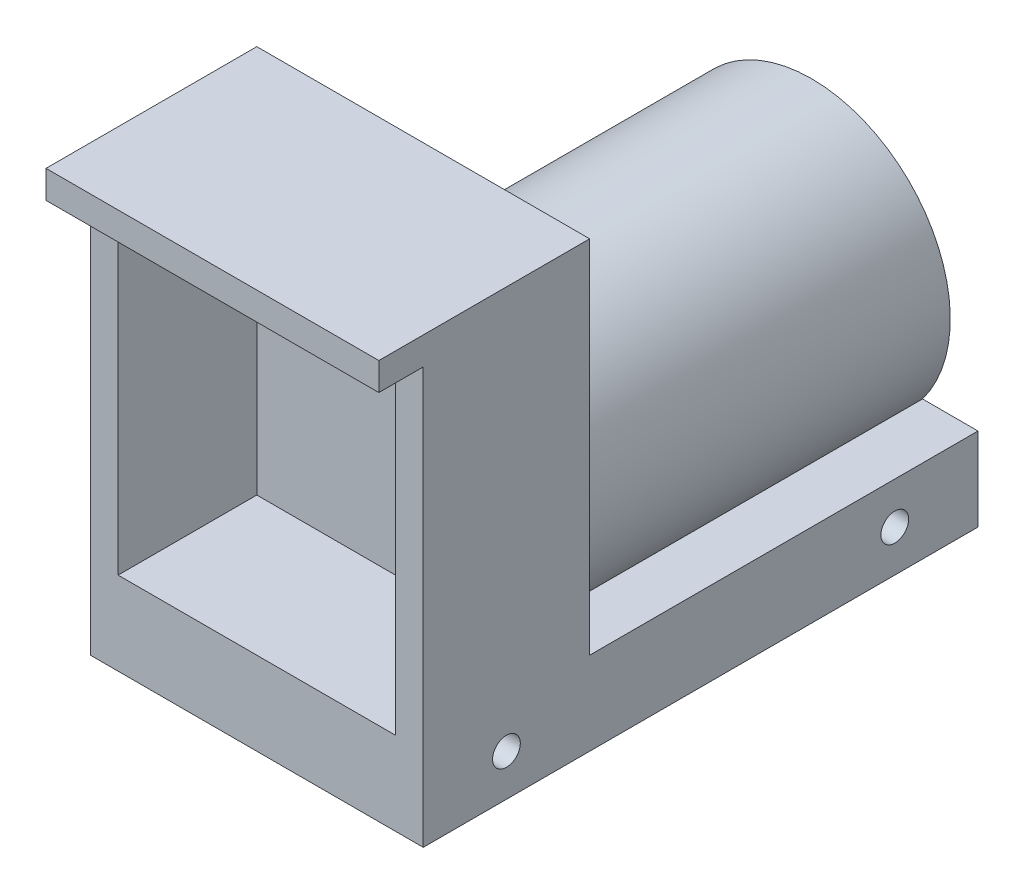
ISO-10303-21;
HEADER;
FILE_DESCRIPTION(('STEP AP214'),'2;1');
FILE_NAME('part.step','',(''),(''),'','','');
FILE_SCHEMA(('AUTOMOTIVE_DESIGN { 1 0 10303 214 1 1 1 1 }'));
ENDSEC;
DATA;
#1=APPLICATION_CONTEXT('core data for automotive mechanical design processes');
#2=APPLICATION_PROTOCOL_DEFINITION('international standard','automotive_design',2000,#1);
#3=PRODUCT_CONTEXT('',#1,'mechanical');
#4=PRODUCT('Part','Part','',(#3));
#5=PRODUCT_RELATED_PRODUCT_CATEGORY('part','',(#4));
#6=PRODUCT_DEFINITION_FORMATION('','',#4);
#7=PRODUCT_DEFINITION_CONTEXT('part definition',#1,'design');
#8=PRODUCT_DEFINITION('design','',#6,#7);
#9=PRODUCT_DEFINITION_SHAPE('','',#8);
#10=(LENGTH_UNIT() NAMED_UNIT(*) SI_UNIT(.MILLI.,.METRE.));
#11=(NAMED_UNIT(*) PLANE_ANGLE_UNIT() SI_UNIT($,.RADIAN.));
#12=(NAMED_UNIT(*) SI_UNIT($,.STERADIAN.) SOLID_ANGLE_UNIT());
#13=UNCERTAINTY_MEASURE_WITH_UNIT(LENGTH_MEASURE(1.E-05),#10,'distance_accuracy_value','');
#14=(GEOMETRIC_REPRESENTATION_CONTEXT(3) GLOBAL_UNCERTAINTY_ASSIGNED_CONTEXT((#13)) GLOBAL_UNIT_ASSIGNED_CONTEXT((#10,
#11,#12)) REPRESENTATION_CONTEXT('',''));
#15=CARTESIAN_POINT('',(0.,0.,0.));
#16=DIRECTION('',(0.,0.,1.));
#17=DIRECTION('',(1.,0.,0.));
#18=AXIS2_PLACEMENT_3D('',#15,#16,#17);
#19=CARTESIAN_POINT('',(30.,15.,-50.));
#20=DIRECTION('',(0.,-1.,0.));
#21=DIRECTION('',(0.,0.,-1.));
#22=AXIS2_PLACEMENT_3D('',#19,#20,#21);
#23=PLANE('',#22);
#24=DIRECTION('',(-1.,0.,0.));
#25=VECTOR('',#24,1.);
#26=CARTESIAN_POINT('',(30.,15.,20.));
#27=LINE('',#26,#25);
#28=CARTESIAN_POINT('',(-20.,15.,20.));
#29=VERTEX_POINT('',#28);
#30=CARTESIAN_POINT('',(-30.,15.,20.));
#31=VERTEX_POINT('',#30);
#32=EDGE_CURVE('E228',#29,#31,#27,.T.);
#33=ORIENTED_EDGE('',*,*,#32,.F.);
#34=DIRECTION('',(0.,0.,-1.));
#35=VECTOR('',#34,1.);
#36=CARTESIAN_POINT('',(-20.,15.,90.7106781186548));
#37=LINE('',#36,#35);
#38=CARTESIAN_POINT('',(-20.,14.9999999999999,-50.));
#39=VERTEX_POINT('',#38);
#40=EDGE_CURVE('E58',#29,#39,#37,.T.);
#41=ORIENTED_EDGE('',*,*,#40,.T.);
#42=DIRECTION('',(-1.,0.,0.));
#43=VECTOR('',#42,1.);
#44=CARTESIAN_POINT('',(30.,15.,-50.));
#45=LINE('',#44,#43);
#46=CARTESIAN_POINT('',(-30.,15.,-50.));
#47=VERTEX_POINT('',#46);
#48=EDGE_CURVE('E232',#39,#47,#45,.T.);
#49=ORIENTED_EDGE('',*,*,#48,.T.);
#50=DIRECTION('',(0.,0.,1.));
#51=VECTOR('',#50,1.);
#52=CARTESIAN_POINT('',(-30.,15.,-50.));
#53=LINE('',#52,#51);
#54=EDGE_CURVE('E206',#47,#31,#53,.T.);
#55=ORIENTED_EDGE('',*,*,#54,.T.);
#56=EDGE_LOOP('',(#33,#41,#49,#55));
#57=FACE_BOUND('',#56,.T.);
#58=ADVANCED_FACE('F35',(#57),#23,.F.);
#59=CARTESIAN_POINT('',(30.,75.,50.));
#60=DIRECTION('',(0.,0.,-1.));
#61=DIRECTION('',(0.,1.,0.));
#62=AXIS2_PLACEMENT_3D('',#59,#60,#61);
#63=PLANE('',#62);
#64=DIRECTION('',(1.,0.,0.));
#65=VECTOR('',#64,1.);
#66=CARTESIAN_POINT('',(-25.,15.,50.));
#67=LINE('',#66,#65);
#68=CARTESIAN_POINT('',(-25.,15.,50.));
#69=VERTEX_POINT('',#68);
#70=CARTESIAN_POINT('',(25.,15.,50.));
#71=VERTEX_POINT('',#70);
#72=EDGE_CURVE('E142',#69,#71,#67,.T.);
#73=ORIENTED_EDGE('',*,*,#72,.F.);
#74=DIRECTION('',(0.,-1.,0.));
#75=VECTOR('',#74,1.);
#76=CARTESIAN_POINT('',(-25.,75.,50.));
#77=LINE('',#76,#75);
#78=CARTESIAN_POINT('',(-25.,75.,50.));
#79=VERTEX_POINT('',#78);
#80=EDGE_CURVE('E150',#79,#69,#77,.T.);
#81=ORIENTED_EDGE('',*,*,#80,.F.);
#82=DIRECTION('',(-1.,0.,0.));
#83=VECTOR('',#82,1.);
#84=CARTESIAN_POINT('',(30.,75.,50.));
#85=LINE('',#84,#83);
#86=CARTESIAN_POINT('',(-30.,75.,50.));
#87=VERTEX_POINT('',#86);
#88=EDGE_CURVE('E198',#79,#87,#85,.T.);
#89=ORIENTED_EDGE('',*,*,#88,.T.);
#90=DIRECTION('',(0.,-1.,0.));
#91=VECTOR('',#90,1.);
#92=CARTESIAN_POINT('',(-30.,75.,50.));
#93=LINE('',#92,#91);
#94=CARTESIAN_POINT('',(-30.,0.,50.));
#95=VERTEX_POINT('',#94);
#96=EDGE_CURVE('E179',#87,#95,#93,.T.);
#97=ORIENTED_EDGE('',*,*,#96,.T.);
#98=DIRECTION('',(-1.,0.,0.));
#99=VECTOR('',#98,1.);
#100=CARTESIAN_POINT('',(30.,0.,50.));
#101=LINE('',#100,#99);
#102=CARTESIAN_POINT('',(30.,0.,50.));
#103=VERTEX_POINT('',#102);
#104=EDGE_CURVE('E12',#103,#95,#101,.T.);
#105=ORIENTED_EDGE('',*,*,#104,.F.);
#106=DIRECTION('',(0.,-1.,0.));
#107=VECTOR('',#106,1.);
#108=CARTESIAN_POINT('',(30.,75.,50.));
#109=LINE('',#108,#107);
#110=CARTESIAN_POINT('',(30.,75.,50.));
#111=VERTEX_POINT('',#110);
#112=EDGE_CURVE('E180',#111,#103,#109,.T.);
#113=ORIENTED_EDGE('',*,*,#112,.F.);
#114=CARTESIAN_POINT('',(25.,75.,50.));
#115=VERTEX_POINT('',#114);
#116=EDGE_CURVE('E217',#111,#115,#85,.T.);
#117=ORIENTED_EDGE('',*,*,#116,.T.);
#118=DIRECTION('',(0.,1.,0.));
#119=VECTOR('',#118,1.);
#120=CARTESIAN_POINT('',(25.,75.,50.));
#121=LINE('',#120,#119);
#122=EDGE_CURVE('E50',#71,#115,#121,.T.);
#123=ORIENTED_EDGE('',*,*,#122,.F.);
#124=EDGE_LOOP('',(#73,#81,#89,#97,#105,#113,#117,#123));
#125=FACE_BOUND('',#124,.T.);
#126=ADVANCED_FACE('F37',(#125),#63,.F.);
#127=CARTESIAN_POINT('',(30.,0.,50.));
#128=DIRECTION('',(0.,1.,0.));
#129=DIRECTION('',(0.,0.,1.));
#130=AXIS2_PLACEMENT_3D('',#127,#128,#129);
#131=PLANE('',#130);
#132=DIRECTION('',(0.,0.,-1.));
#133=VECTOR('',#132,1.);
#134=CARTESIAN_POINT('',(-30.,0.,50.));
#135=LINE('',#134,#133);
#136=CARTESIAN_POINT('',(-30.,0.,-50.));
#137=VERTEX_POINT('',#136);
#138=EDGE_CURVE('E201',#95,#137,#135,.T.);
#139=ORIENTED_EDGE('',*,*,#138,.T.);
#140=DIRECTION('',(-1.,0.,0.));
#141=VECTOR('',#140,1.);
#142=CARTESIAN_POINT('',(30.,0.,-50.));
#143=LINE('',#142,#141);
#144=CARTESIAN_POINT('',(30.,0.,-50.));
#145=VERTEX_POINT('',#144);
#146=EDGE_CURVE('E43',#145,#137,#143,.T.);
#147=ORIENTED_EDGE('',*,*,#146,.F.);
#148=DIRECTION('',(0.,0.,-1.));
#149=VECTOR('',#148,1.);
#150=CARTESIAN_POINT('',(30.,0.,50.));
#151=LINE('',#150,#149);
#152=EDGE_CURVE('E183',#103,#145,#151,.T.);
#153=ORIENTED_EDGE('',*,*,#152,.F.);
#154=ORIENTED_EDGE('',*,*,#104,.T.);
#155=EDGE_LOOP('',(#139,#147,#153,#154));
#156=FACE_BOUND('',#155,.T.);
#157=ADVANCED_FACE('F262',(#156),#131,.F.);
#158=CARTESIAN_POINT('',(30.,0.,-50.));
#159=DIRECTION('',(0.,0.,1.));
#160=DIRECTION('',(0.,-1.,0.));
#161=AXIS2_PLACEMENT_3D('',#158,#159,#160);
#162=PLANE('',#161);
#163=ORIENTED_EDGE('',*,*,#48,.F.);
#164=CARTESIAN_POINT('',(0.,30.,-50.));
#165=DIRECTION('',(0.,0.,-1.));
#166=DIRECTION('',(0.,1.,0.));
#167=AXIS2_PLACEMENT_3D('',#164,#165,#166);
#168=CIRCLE('',#167,25.);
#169=CARTESIAN_POINT('',(20.,14.9999999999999,-50.));
#170=VERTEX_POINT('',#169);
#171=EDGE_CURVE('E169',#39,#170,#168,.T.);
#172=ORIENTED_EDGE('',*,*,#171,.T.);
#173=CARTESIAN_POINT('',(30.,15.,-50.));
#174=VERTEX_POINT('',#173);
#175=EDGE_CURVE('E233',#174,#170,#45,.T.);
#176=ORIENTED_EDGE('',*,*,#175,.F.);
#177=DIRECTION('',(0.,1.,0.));
#178=VECTOR('',#177,1.);
#179=CARTESIAN_POINT('',(30.,0.,-50.));
#180=LINE('',#179,#178);
#181=EDGE_CURVE('E186',#145,#174,#180,.T.);
#182=ORIENTED_EDGE('',*,*,#181,.F.);
#183=ORIENTED_EDGE('',*,*,#146,.T.);
#184=DIRECTION('',(0.,1.,0.));
#185=VECTOR('',#184,1.);
#186=CARTESIAN_POINT('',(-30.,0.,-50.));
#187=LINE('',#186,#185);
#188=EDGE_CURVE('E203',#137,#47,#187,.T.);
#189=ORIENTED_EDGE('',*,*,#188,.T.);
#190=EDGE_LOOP('',(#163,#172,#176,#182,#183,#189));
#191=FACE_BOUND('',#190,.T.);
#192=ADVANCED_FACE('F241',(#191),#162,.F.);
#193=ORIENTED_EDGE('',*,*,#175,.T.);
#194=DIRECTION('',(0.,0.,-1.));
#195=VECTOR('',#194,1.);
#196=CARTESIAN_POINT('',(20.,15.,90.7106781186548));
#197=LINE('',#196,#195);
#198=CARTESIAN_POINT('',(20.,15.,20.));
#199=VERTEX_POINT('',#198);
#200=EDGE_CURVE('E175',#170,#199,#197,.F.);
#201=ORIENTED_EDGE('',*,*,#200,.T.);
#202=CARTESIAN_POINT('',(30.,15.,20.));
#203=VERTEX_POINT('',#202);
#204=EDGE_CURVE('E229',#203,#199,#27,.T.);
#205=ORIENTED_EDGE('',*,*,#204,.F.);
#206=DIRECTION('',(0.,0.,1.));
#207=VECTOR('',#206,1.);
#208=CARTESIAN_POINT('',(30.,15.,-50.));
#209=LINE('',#208,#207);
#210=EDGE_CURVE('E188',#174,#203,#209,.T.);
#211=ORIENTED_EDGE('',*,*,#210,.F.);
#212=EDGE_LOOP('',(#193,#201,#205,#211));
#213=FACE_BOUND('',#212,.T.);
#214=ADVANCED_FACE('F254',(#213),#23,.F.);
#215=CARTESIAN_POINT('',(30.,15.,20.));
#216=DIRECTION('',(0.,0.,1.));
#217=DIRECTION('',(0.,-1.,0.));
#218=AXIS2_PLACEMENT_3D('',#215,#216,#217);
#219=PLANE('',#218);
#220=ORIENTED_EDGE('',*,*,#204,.T.);
#221=CARTESIAN_POINT('',(0.,30.,20.));
#222=DIRECTION('',(0.,0.,1.));
#223=DIRECTION('',(0.,-1.,0.));
#224=AXIS2_PLACEMENT_3D('',#221,#222,#223);
#225=CIRCLE('',#224,25.);
#226=EDGE_CURVE('E173',#29,#199,#225,.F.);
#227=ORIENTED_EDGE('',*,*,#226,.F.);
#228=ORIENTED_EDGE('',*,*,#32,.T.);
#229=DIRECTION('',(0.,1.,0.));
#230=VECTOR('',#229,1.);
#231=CARTESIAN_POINT('',(-30.,15.,20.));
#232=LINE('',#231,#230);
#233=CARTESIAN_POINT('',(-30.,80.,20.));
#234=VERTEX_POINT('',#233);
#235=EDGE_CURVE('E209',#31,#234,#232,.T.);
#236=ORIENTED_EDGE('',*,*,#235,.T.);
#237=DIRECTION('',(-1.,0.,0.));
#238=VECTOR('',#237,1.);
#239=CARTESIAN_POINT('',(30.,80.,20.));
#240=LINE('',#239,#238);
#241=CARTESIAN_POINT('',(30.,80.,20.));
#242=VERTEX_POINT('',#241);
#243=EDGE_CURVE('E225',#242,#234,#240,.T.);
#244=ORIENTED_EDGE('',*,*,#243,.F.);
#245=DIRECTION('',(0.,1.,0.));
#246=VECTOR('',#245,1.);
#247=CARTESIAN_POINT('',(30.,15.,20.));
#248=LINE('',#247,#246);
#249=EDGE_CURVE('E190',#203,#242,#248,.T.);
#250=ORIENTED_EDGE('',*,*,#249,.F.);
#251=EDGE_LOOP('',(#220,#227,#228,#236,#244,#250));
#252=FACE_BOUND('',#251,.T.);
#253=ADVANCED_FACE('F278',(#252),#219,.F.);
#254=CARTESIAN_POINT('',(30.,80.,20.));
#255=DIRECTION('',(0.,-1.,0.));
#256=DIRECTION('',(0.,0.,-1.));
#257=AXIS2_PLACEMENT_3D('',#254,#255,#256);
#258=PLANE('',#257);
#259=DIRECTION('',(0.,0.,1.));
#260=VECTOR('',#259,1.);
#261=CARTESIAN_POINT('',(-30.,80.,20.));
#262=LINE('',#261,#260);
#263=CARTESIAN_POINT('',(-30.,80.,58.));
#264=VERTEX_POINT('',#263);
#265=EDGE_CURVE('E211',#234,#264,#262,.T.);
#266=ORIENTED_EDGE('',*,*,#265,.T.);
#267=DIRECTION('',(-1.,0.,0.));
#268=VECTOR('',#267,1.);
#269=CARTESIAN_POINT('',(30.,80.,58.));
#270=LINE('',#269,#268);
#271=CARTESIAN_POINT('',(30.,80.,58.));
#272=VERTEX_POINT('',#271);
#273=EDGE_CURVE('E222',#272,#264,#270,.T.);
#274=ORIENTED_EDGE('',*,*,#273,.F.);
#275=DIRECTION('',(0.,0.,1.));
#276=VECTOR('',#275,1.);
#277=CARTESIAN_POINT('',(30.,80.,20.));
#278=LINE('',#277,#276);
#279=EDGE_CURVE('E192',#242,#272,#278,.T.);
#280=ORIENTED_EDGE('',*,*,#279,.F.);
#281=ORIENTED_EDGE('',*,*,#243,.T.);
#282=EDGE_LOOP('',(#266,#274,#280,#281));
#283=FACE_BOUND('',#282,.T.);
#284=ADVANCED_FACE('F276',(#283),#258,.F.);
#285=CARTESIAN_POINT('',(30.,80.,58.));
#286=DIRECTION('',(0.,0.,-1.));
#287=DIRECTION('',(-1.,0.,0.));
#288=AXIS2_PLACEMENT_3D('',#285,#286,#287);
#289=PLANE('',#288);
#290=DIRECTION('',(0.,-1.,0.));
#291=VECTOR('',#290,1.);
#292=CARTESIAN_POINT('',(-30.,80.,58.));
#293=LINE('',#292,#291);
#294=CARTESIAN_POINT('',(-30.,75.,58.));
#295=VERTEX_POINT('',#294);
#296=EDGE_CURVE('E213',#264,#295,#293,.T.);
#297=ORIENTED_EDGE('',*,*,#296,.T.);
#298=DIRECTION('',(-1.,0.,0.));
#299=VECTOR('',#298,1.);
#300=CARTESIAN_POINT('',(30.,75.,58.));
#301=LINE('',#300,#299);
#302=CARTESIAN_POINT('',(30.,75.,58.));
#303=VERTEX_POINT('',#302);
#304=EDGE_CURVE('E219',#303,#295,#301,.T.);
#305=ORIENTED_EDGE('',*,*,#304,.F.);
#306=DIRECTION('',(0.,-1.,0.));
#307=VECTOR('',#306,1.);
#308=CARTESIAN_POINT('',(30.,80.,58.));
#309=LINE('',#308,#307);
#310=EDGE_CURVE('E194',#272,#303,#309,.T.);
#311=ORIENTED_EDGE('',*,*,#310,.F.);
#312=ORIENTED_EDGE('',*,*,#273,.T.);
#313=EDGE_LOOP('',(#297,#305,#311,#312));
#314=FACE_BOUND('',#313,.T.);
#315=ADVANCED_FACE('F272',(#314),#289,.F.);
#316=CARTESIAN_POINT('',(30.,75.,58.));
#317=DIRECTION('',(0.,1.,0.));
#318=DIRECTION('',(0.,0.,1.));
#319=AXIS2_PLACEMENT_3D('',#316,#317,#318);
#320=PLANE('',#319);
#321=DIRECTION('',(0.,0.,-1.));
#322=VECTOR('',#321,1.);
#323=CARTESIAN_POINT('',(-30.,75.,58.));
#324=LINE('',#323,#322);
#325=EDGE_CURVE('E184',#295,#87,#324,.T.);
#326=ORIENTED_EDGE('',*,*,#325,.T.);
#327=ORIENTED_EDGE('',*,*,#88,.F.);
#328=DIRECTION('',(0.,0.,1.));
#329=VECTOR('',#328,1.);
#330=CARTESIAN_POINT('',(-25.,75.,-58.1024967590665));
#331=LINE('',#330,#329);
#332=CARTESIAN_POINT('',(-25.,75.,25.));
#333=VERTEX_POINT('',#332);
#334=EDGE_CURVE('E153',#333,#79,#331,.T.);
#335=ORIENTED_EDGE('',*,*,#334,.F.);
#336=DIRECTION('',(1.,0.,0.));
#337=VECTOR('',#336,1.);
#338=CARTESIAN_POINT('',(-25.,75.,25.));
#339=LINE('',#338,#337);
#340=CARTESIAN_POINT('',(25.,75.,25.));
#341=VERTEX_POINT('',#340);
#342=EDGE_CURVE('E413',#333,#341,#339,.T.);
#343=ORIENTED_EDGE('',*,*,#342,.T.);
#344=DIRECTION('',(0.,0.,1.));
#345=VECTOR('',#344,1.);
#346=CARTESIAN_POINT('',(25.,75.,-58.1024967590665));
#347=LINE('',#346,#345);
#348=EDGE_CURVE('E165',#341,#115,#347,.T.);
#349=ORIENTED_EDGE('',*,*,#348,.T.);
#350=ORIENTED_EDGE('',*,*,#116,.F.);
#351=DIRECTION('',(0.,0.,-1.));
#352=VECTOR('',#351,1.);
#353=CARTESIAN_POINT('',(30.,75.,58.));
#354=LINE('',#353,#352);
#355=EDGE_CURVE('E196',#303,#111,#354,.T.);
#356=ORIENTED_EDGE('',*,*,#355,.F.);
#357=ORIENTED_EDGE('',*,*,#304,.T.);
#358=EDGE_LOOP('',(#326,#327,#335,#343,#349,#350,#356,#357));
#359=FACE_BOUND('',#358,.T.);
#360=ADVANCED_FACE('F266',(#359),#320,.F.);
#361=CARTESIAN_POINT('',(30.,0.,0.));
#362=DIRECTION('',(1.,0.,0.));
#363=DIRECTION('',(0.,0.,-1.));
#364=AXIS2_PLACEMENT_3D('',#361,#362,#363);
#365=PLANE('',#364);
#366=CARTESIAN_POINT('',(30.,7.50000000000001,-35.));
#367=DIRECTION('',(1.,0.,0.));
#368=DIRECTION('',(0.,0.,-1.));
#369=AXIS2_PLACEMENT_3D('',#366,#367,#368);
#370=CIRCLE('',#369,2.5);
#371=CARTESIAN_POINT('',(30.,7.50000000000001,-37.5));
#372=VERTEX_POINT('',#371);
#373=EDGE_CURVE('E403',#372,#372,#370,.T.);
#374=ORIENTED_EDGE('',*,*,#373,.F.);
#375=EDGE_LOOP('',(#374));
#376=FACE_BOUND('',#375,.T.);
#377=CARTESIAN_POINT('',(30.,7.50000000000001,35.));
#378=DIRECTION('',(1.,0.,0.));
#379=DIRECTION('',(0.,0.,-1.));
#380=AXIS2_PLACEMENT_3D('',#377,#378,#379);
#381=CIRCLE('',#380,2.5);
#382=CARTESIAN_POINT('',(30.,7.50000000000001,32.5));
#383=VERTEX_POINT('',#382);
#384=EDGE_CURVE('E405',#383,#383,#381,.T.);
#385=ORIENTED_EDGE('',*,*,#384,.F.);
#386=EDGE_LOOP('',(#385));
#387=FACE_BOUND('',#386,.T.);
#388=ORIENTED_EDGE('',*,*,#112,.T.);
#389=ORIENTED_EDGE('',*,*,#152,.T.);
#390=ORIENTED_EDGE('',*,*,#181,.T.);
#391=ORIENTED_EDGE('',*,*,#210,.T.);
#392=ORIENTED_EDGE('',*,*,#249,.T.);
#393=ORIENTED_EDGE('',*,*,#279,.T.);
#394=ORIENTED_EDGE('',*,*,#310,.T.);
#395=ORIENTED_EDGE('',*,*,#355,.T.);
#396=EDGE_LOOP('',(#388,#389,#390,#391,#392,#393,#394,#395));
#397=FACE_BOUND('',#396,.T.);
#398=ADVANCED_FACE('F258',(#376,#387,#397),#365,.T.);
#399=CARTESIAN_POINT('',(-30.,0.,0.));
#400=DIRECTION('',(1.,0.,0.));
#401=DIRECTION('',(0.,0.,-1.));
#402=AXIS2_PLACEMENT_3D('',#399,#400,#401);
#403=PLANE('',#402);
#404=CARTESIAN_POINT('',(-30.,7.50000000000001,-35.));
#405=DIRECTION('',(1.,0.,0.));
#406=DIRECTION('',(0.,0.,-1.));
#407=AXIS2_PLACEMENT_3D('',#404,#405,#406);
#408=CIRCLE('',#407,2.5);
#409=CARTESIAN_POINT('',(-30.,7.50000000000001,-37.5));
#410=VERTEX_POINT('',#409);
#411=EDGE_CURVE('E400',#410,#410,#408,.T.);
#412=ORIENTED_EDGE('',*,*,#411,.T.);
#413=EDGE_LOOP('',(#412));
#414=FACE_BOUND('',#413,.T.);
#415=CARTESIAN_POINT('',(-30.,7.50000000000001,35.));
#416=DIRECTION('',(1.,0.,0.));
#417=DIRECTION('',(0.,0.,-1.));
#418=AXIS2_PLACEMENT_3D('',#415,#416,#417);
#419=CIRCLE('',#418,2.5);
#420=CARTESIAN_POINT('',(-30.,7.50000000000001,32.5));
#421=VERTEX_POINT('',#420);
#422=EDGE_CURVE('E156',#421,#421,#419,.T.);
#423=ORIENTED_EDGE('',*,*,#422,.T.);
#424=EDGE_LOOP('',(#423));
#425=FACE_BOUND('',#424,.T.);
#426=ORIENTED_EDGE('',*,*,#96,.F.);
#427=ORIENTED_EDGE('',*,*,#325,.F.);
#428=ORIENTED_EDGE('',*,*,#296,.F.);
#429=ORIENTED_EDGE('',*,*,#265,.F.);
#430=ORIENTED_EDGE('',*,*,#235,.F.);
#431=ORIENTED_EDGE('',*,*,#54,.F.);
#432=ORIENTED_EDGE('',*,*,#188,.F.);
#433=ORIENTED_EDGE('',*,*,#138,.F.);
#434=EDGE_LOOP('',(#426,#427,#428,#429,#430,#431,#432,#433));
#435=FACE_BOUND('',#434,.T.);
#436=ADVANCED_FACE('F247',(#414,#425,#435),#403,.F.);
#437=CARTESIAN_POINT('',(0.,30.,90.7106781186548));
#438=DIRECTION('',(0.,0.,-1.));
#439=DIRECTION('',(0.,1.,0.));
#440=AXIS2_PLACEMENT_3D('',#437,#438,#439);
#441=CYLINDRICAL_SURFACE('',#440,25.);
#442=ORIENTED_EDGE('',*,*,#40,.F.);
#443=ORIENTED_EDGE('',*,*,#226,.T.);
#444=ORIENTED_EDGE('',*,*,#200,.F.);
#445=ORIENTED_EDGE('',*,*,#171,.F.);
#446=EDGE_LOOP('',(#442,#443,#444,#445));
#447=FACE_BOUND('',#446,.T.);
#448=ADVANCED_FACE('F279',(#447),#441,.T.);
#449=CARTESIAN_POINT('',(-25.,75.,-58.1024967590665));
#450=DIRECTION('',(-1.,0.,0.));
#451=DIRECTION('',(0.,-1.,0.));
#452=AXIS2_PLACEMENT_3D('',#449,#450,#451);
#453=PLANE('',#452);
#454=DIRECTION('',(0.,1.,0.));
#455=VECTOR('',#454,1.);
#456=CARTESIAN_POINT('',(-25.,75.,25.));
#457=LINE('',#456,#455);
#458=CARTESIAN_POINT('',(-25.,15.,25.));
#459=VERTEX_POINT('',#458);
#460=EDGE_CURVE('E170',#459,#333,#457,.T.);
#461=ORIENTED_EDGE('',*,*,#460,.T.);
#462=ORIENTED_EDGE('',*,*,#334,.T.);
#463=ORIENTED_EDGE('',*,*,#80,.T.);
#464=DIRECTION('',(0.,0.,1.));
#465=VECTOR('',#464,1.);
#466=CARTESIAN_POINT('',(-25.,15.,-58.1024967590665));
#467=LINE('',#466,#465);
#468=EDGE_CURVE('E137',#459,#69,#467,.T.);
#469=ORIENTED_EDGE('',*,*,#468,.F.);
#470=EDGE_LOOP('',(#461,#462,#463,#469));
#471=FACE_BOUND('',#470,.T.);
#472=ADVANCED_FACE('F151',(#471),#453,.F.);
#473=CARTESIAN_POINT('',(25.,75.,-58.1024967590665));
#474=DIRECTION('',(1.,0.,0.));
#475=DIRECTION('',(0.,1.,0.));
#476=AXIS2_PLACEMENT_3D('',#473,#474,#475);
#477=PLANE('',#476);
#478=DIRECTION('',(0.,-1.,0.));
#479=VECTOR('',#478,1.);
#480=CARTESIAN_POINT('',(25.,75.,25.));
#481=LINE('',#480,#479);
#482=CARTESIAN_POINT('',(25.,15.,25.));
#483=VERTEX_POINT('',#482);
#484=EDGE_CURVE('E164',#341,#483,#481,.T.);
#485=ORIENTED_EDGE('',*,*,#484,.T.);
#486=DIRECTION('',(0.,0.,1.));
#487=VECTOR('',#486,1.);
#488=CARTESIAN_POINT('',(25.,15.,-58.1024967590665));
#489=LINE('',#488,#487);
#490=EDGE_CURVE('E147',#483,#71,#489,.T.);
#491=ORIENTED_EDGE('',*,*,#490,.T.);
#492=ORIENTED_EDGE('',*,*,#122,.T.);
#493=ORIENTED_EDGE('',*,*,#348,.F.);
#494=EDGE_LOOP('',(#485,#491,#492,#493));
#495=FACE_BOUND('',#494,.T.);
#496=ADVANCED_FACE('F286',(#495),#477,.F.);
#497=CARTESIAN_POINT('',(-25.,15.,-58.1024967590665));
#498=DIRECTION('',(0.,-1.,0.));
#499=DIRECTION('',(0.,0.,-1.));
#500=AXIS2_PLACEMENT_3D('',#497,#498,#499);
#501=PLANE('',#500);
#502=DIRECTION('',(-1.,0.,0.));
#503=VECTOR('',#502,1.);
#504=CARTESIAN_POINT('',(-25.,15.,25.));
#505=LINE('',#504,#503);
#506=EDGE_CURVE('E144',#483,#459,#505,.T.);
#507=ORIENTED_EDGE('',*,*,#506,.T.);
#508=ORIENTED_EDGE('',*,*,#468,.T.);
#509=ORIENTED_EDGE('',*,*,#72,.T.);
#510=ORIENTED_EDGE('',*,*,#490,.F.);
#511=EDGE_LOOP('',(#507,#508,#509,#510));
#512=FACE_BOUND('',#511,.T.);
#513=ADVANCED_FACE('F139',(#512),#501,.F.);
#514=CARTESIAN_POINT('',(30.,15.,25.));
#515=DIRECTION('',(0.,0.,1.));
#516=DIRECTION('',(0.,-1.,0.));
#517=AXIS2_PLACEMENT_3D('',#514,#515,#516);
#518=PLANE('',#517);
#519=ORIENTED_EDGE('',*,*,#460,.F.);
#520=ORIENTED_EDGE('',*,*,#506,.F.);
#521=ORIENTED_EDGE('',*,*,#484,.F.);
#522=ORIENTED_EDGE('',*,*,#342,.F.);
#523=EDGE_LOOP('',(#519,#520,#521,#522));
#524=FACE_BOUND('',#523,.T.);
#525=ADVANCED_FACE('F350',(#524),#518,.T.);
#526=CARTESIAN_POINT('',(-30.,7.50000000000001,35.));
#527=DIRECTION('',(1.,0.,0.));
#528=DIRECTION('',(0.,0.,-1.));
#529=AXIS2_PLACEMENT_3D('',#526,#527,#528);
#530=CYLINDRICAL_SURFACE('',#529,2.5);
#531=ORIENTED_EDGE('',*,*,#422,.F.);
#532=EDGE_LOOP('',(#531));
#533=FACE_BOUND('',#532,.T.);
#534=ORIENTED_EDGE('',*,*,#384,.T.);
#535=EDGE_LOOP('',(#534));
#536=FACE_BOUND('',#535,.T.);
#537=ADVANCED_FACE('F359',(#533,#536),#530,.F.);
#538=CARTESIAN_POINT('',(-30.,7.50000000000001,-35.));
#539=DIRECTION('',(1.,0.,0.));
#540=DIRECTION('',(0.,0.,-1.));
#541=AXIS2_PLACEMENT_3D('',#538,#539,#540);
#542=CYLINDRICAL_SURFACE('',#541,2.5);
#543=ORIENTED_EDGE('',*,*,#411,.F.);
#544=EDGE_LOOP('',(#543));
#545=FACE_BOUND('',#544,.T.);
#546=ORIENTED_EDGE('',*,*,#373,.T.);
#547=EDGE_LOOP('',(#546));
#548=FACE_BOUND('',#547,.T.);
#549=ADVANCED_FACE('F383',(#545,#548),#542,.F.);
#550=CLOSED_SHELL('',(#58,#126,#157,#192,#214,#253,#284,#315,#360,#398,#436,#448,#472,#496,#513,
#525,#537,#549));
#551=MANIFOLD_SOLID_BREP('B2',#550);
#552=ADVANCED_BREP_SHAPE_REPRESENTATION('',(#18,#551),#14);
#553=SHAPE_DEFINITION_REPRESENTATION(#9,#552);
ENDSEC;
END-ISO-10303-21;
